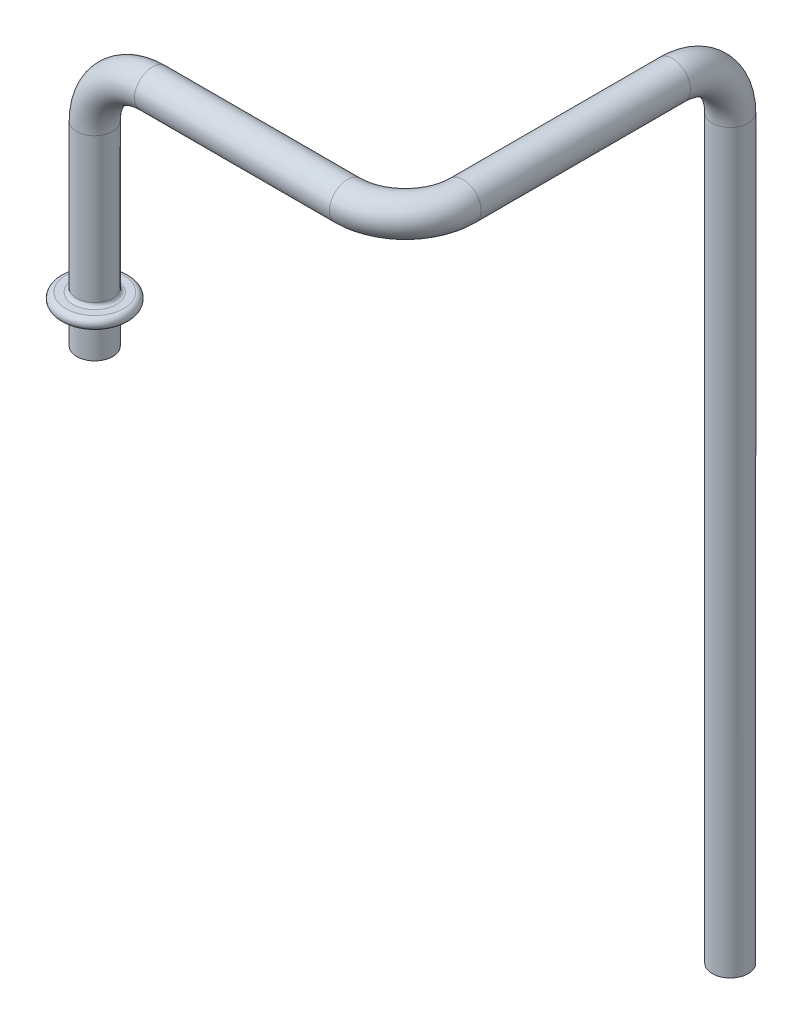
ISO-10303-21;
HEADER;
FILE_DESCRIPTION(('STEP AP214'),'2;1');
FILE_NAME('part.step','',(''),(''),'','','');
FILE_SCHEMA(('AUTOMOTIVE_DESIGN { 1 0 10303 214 1 1 1 1 }'));
ENDSEC;
DATA;
#1=APPLICATION_CONTEXT('core data for automotive mechanical design processes');
#2=APPLICATION_PROTOCOL_DEFINITION('international standard','automotive_design',2000,#1);
#3=PRODUCT_CONTEXT('',#1,'mechanical');
#4=PRODUCT('Part','Part','',(#3));
#5=PRODUCT_RELATED_PRODUCT_CATEGORY('part','',(#4));
#6=PRODUCT_DEFINITION_FORMATION('','',#4);
#7=PRODUCT_DEFINITION_CONTEXT('part definition',#1,'design');
#8=PRODUCT_DEFINITION('design','',#6,#7);
#9=PRODUCT_DEFINITION_SHAPE('','',#8);
#10=(LENGTH_UNIT() NAMED_UNIT(*) SI_UNIT(.MILLI.,.METRE.));
#11=(NAMED_UNIT(*) PLANE_ANGLE_UNIT() SI_UNIT($,.RADIAN.));
#12=(NAMED_UNIT(*) SI_UNIT($,.STERADIAN.) SOLID_ANGLE_UNIT());
#13=UNCERTAINTY_MEASURE_WITH_UNIT(LENGTH_MEASURE(1.E-05),#10,'distance_accuracy_value','');
#14=(GEOMETRIC_REPRESENTATION_CONTEXT(3) GLOBAL_UNCERTAINTY_ASSIGNED_CONTEXT((#13)) GLOBAL_UNIT_ASSIGNED_CONTEXT((#10,
#11,#12)) REPRESENTATION_CONTEXT('',''));
#15=CARTESIAN_POINT('',(0.,0.,0.));
#16=DIRECTION('',(0.,0.,1.));
#17=DIRECTION('',(1.,0.,0.));
#18=AXIS2_PLACEMENT_3D('',#15,#16,#17);
#19=CARTESIAN_POINT('',(0.,27.,0.));
#20=DIRECTION('',(0.,-1.,0.));
#21=DIRECTION('',(0.,0.,-1.));
#22=AXIS2_PLACEMENT_3D('',#19,#20,#21);
#23=CYLINDRICAL_SURFACE('',#22,2.5);
#24=CARTESIAN_POINT('',(0.,4.5,0.));
#25=DIRECTION('',(0.,1.,0.));
#26=DIRECTION('',(0.,0.,1.));
#27=AXIS2_PLACEMENT_3D('',#24,#25,#26);
#28=CIRCLE('',#27,2.5);
#29=CARTESIAN_POINT('',(0.,4.5,2.5));
#30=VERTEX_POINT('',#29);
#31=EDGE_CURVE('E48',#30,#30,#28,.F.);
#32=ORIENTED_EDGE('',*,*,#31,.T.);
#33=EDGE_LOOP('',(#32));
#34=FACE_BOUND('',#33,.T.);
#35=CARTESIAN_POINT('',(0.,0.,0.));
#36=DIRECTION('',(0.,1.,0.));
#37=DIRECTION('',(0.,0.,1.));
#38=AXIS2_PLACEMENT_3D('',#35,#36,#37);
#39=CIRCLE('',#38,2.5);
#40=CARTESIAN_POINT('',(0.,0.,2.5));
#41=VERTEX_POINT('',#40);
#42=EDGE_CURVE('E80',#41,#41,#39,.T.);
#43=ORIENTED_EDGE('',*,*,#42,.T.);
#44=EDGE_LOOP('',(#43));
#45=FACE_BOUND('',#44,.T.);
#46=ADVANCED_FACE('F34',(#34,#45),#23,.T.);
#47=CARTESIAN_POINT('',(0.,7.,0.));
#48=DIRECTION('',(0.,-1.,0.));
#49=DIRECTION('',(0.,0.,-1.));
#50=AXIS2_PLACEMENT_3D('',#47,#48,#49);
#51=CIRCLE('',#50,2.5);
#52=CARTESIAN_POINT('',(0.,7.,-2.5));
#53=VERTEX_POINT('',#52);
#54=EDGE_CURVE('E10',#53,#53,#51,.F.);
#55=ORIENTED_EDGE('',*,*,#54,.T.);
#56=EDGE_LOOP('',(#55));
#57=FACE_BOUND('',#56,.T.);
#58=CARTESIAN_POINT('',(0.,27.,0.));
#59=DIRECTION('',(0.,1.,0.));
#60=DIRECTION('',(0.,0.,1.));
#61=AXIS2_PLACEMENT_3D('',#58,#59,#60);
#62=CIRCLE('',#61,2.5);
#63=CARTESIAN_POINT('',(-2.5,27.,0.));
#64=VERTEX_POINT('',#63);
#65=EDGE_CURVE('E79',#64,#64,#62,.T.);
#66=ORIENTED_EDGE('',*,*,#65,.F.);
#67=EDGE_LOOP('',(#66));
#68=FACE_BOUND('',#67,.T.);
#69=ADVANCED_FACE('F137',(#57,#68),#23,.T.);
#70=CARTESIAN_POINT('',(43.,27.,-45.));
#71=DIRECTION('',(0.,-1.,0.));
#72=DIRECTION('',(0.,0.,-1.));
#73=AXIS2_PLACEMENT_3D('',#70,#71,#72);
#74=CYLINDRICAL_SURFACE('',#73,2.5);
#75=CARTESIAN_POINT('',(43.,27.,-45.));
#76=DIRECTION('',(0.,-1.,0.));
#77=DIRECTION('',(1.,0.,0.));
#78=AXIS2_PLACEMENT_3D('',#75,#76,#77);
#79=CIRCLE('',#78,2.5);
#80=CARTESIAN_POINT('',(43.,27.,-47.5));
#81=VERTEX_POINT('',#80);
#82=EDGE_CURVE('E61',#81,#81,#79,.T.);
#83=ORIENTED_EDGE('',*,*,#82,.T.);
#84=EDGE_LOOP('',(#83));
#85=FACE_BOUND('',#84,.T.);
#86=CARTESIAN_POINT('',(43.,-75.,-45.));
#87=DIRECTION('',(0.,-1.,0.));
#88=DIRECTION('',(1.,0.,0.));
#89=AXIS2_PLACEMENT_3D('',#86,#87,#88);
#90=CIRCLE('',#89,2.5);
#91=CARTESIAN_POINT('',(45.5,-75.,-45.));
#92=VERTEX_POINT('',#91);
#93=EDGE_CURVE('E58',#92,#92,#90,.T.);
#94=ORIENTED_EDGE('',*,*,#93,.F.);
#95=EDGE_LOOP('',(#94));
#96=FACE_BOUND('',#95,.T.);
#97=ADVANCED_FACE('F143',(#85,#96),#74,.T.);
#98=CARTESIAN_POINT('',(43.,27.,-37.));
#99=DIRECTION('',(-1.,0.,0.));
#100=DIRECTION('',(0.,0.,1.));
#101=AXIS2_PLACEMENT_3D('',#98,#99,#100);
#102=TOROIDAL_SURFACE('',#101,8.,2.5);
#103=CARTESIAN_POINT('',(43.,35.,-37.));
#104=DIRECTION('',(0.,0.,-1.));
#105=DIRECTION('',(1.,0.,0.));
#106=AXIS2_PLACEMENT_3D('',#103,#104,#105);
#107=CIRCLE('',#106,2.5);
#108=CARTESIAN_POINT('',(43.,37.5,-37.));
#109=VERTEX_POINT('',#108);
#110=EDGE_CURVE('E65',#109,#109,#107,.T.);
#111=CARTESIAN_POINT('',(43.,27.,-37.));
#112=DIRECTION('',(-1.,0.,0.));
#113=DIRECTION('',(0.,0.,1.));
#114=AXIS2_PLACEMENT_3D('',#111,#112,#113);
#115=CIRCLE('',#114,10.5);
#116=EDGE_CURVE('',#109,#81,#115,.T.);
#117=ORIENTED_EDGE('',*,*,#110,.T.);
#118=ORIENTED_EDGE('',*,*,#82,.F.);
#119=ORIENTED_EDGE('',*,*,#116,.T.);
#120=ORIENTED_EDGE('',*,*,#116,.F.);
#121=EDGE_LOOP('',(#117,#119,#118,#120));
#122=FACE_BOUND('',#121,.T.);
#123=ADVANCED_FACE('F165',(#122),#102,.T.);
#124=CARTESIAN_POINT('',(43.,35.,-8.));
#125=DIRECTION('',(0.,0.,-1.));
#126=DIRECTION('',(-1.,0.,0.));
#127=AXIS2_PLACEMENT_3D('',#124,#125,#126);
#128=CYLINDRICAL_SURFACE('',#127,2.5);
#129=CARTESIAN_POINT('',(43.,35.,-8.));
#130=DIRECTION('',(0.,0.,-1.));
#131=DIRECTION('',(1.,0.,0.));
#132=AXIS2_PLACEMENT_3D('',#129,#130,#131);
#133=CIRCLE('',#132,2.5);
#134=CARTESIAN_POINT('',(45.5,35.,-8.));
#135=VERTEX_POINT('',#134);
#136=EDGE_CURVE('E68',#135,#135,#133,.T.);
#137=ORIENTED_EDGE('',*,*,#136,.T.);
#138=EDGE_LOOP('',(#137));
#139=FACE_BOUND('',#138,.T.);
#140=ORIENTED_EDGE('',*,*,#110,.F.);
#141=EDGE_LOOP('',(#140));
#142=FACE_BOUND('',#141,.T.);
#143=ADVANCED_FACE('F161',(#139,#142),#128,.T.);
#144=CARTESIAN_POINT('',(35.,35.,-8.));
#145=DIRECTION('',(0.,1.,0.));
#146=DIRECTION('',(0.,0.,1.));
#147=AXIS2_PLACEMENT_3D('',#144,#145,#146);
#148=TOROIDAL_SURFACE('',#147,8.,2.5);
#149=CARTESIAN_POINT('',(35.,35.,0.));
#150=DIRECTION('',(1.,0.,0.));
#151=DIRECTION('',(0.,0.,1.));
#152=AXIS2_PLACEMENT_3D('',#149,#150,#151);
#153=CIRCLE('',#152,2.5);
#154=CARTESIAN_POINT('',(35.,35.,2.5));
#155=VERTEX_POINT('',#154);
#156=EDGE_CURVE('E72',#155,#155,#153,.T.);
#157=CARTESIAN_POINT('',(35.,35.,-8.));
#158=DIRECTION('',(0.,1.,0.));
#159=DIRECTION('',(0.,0.,1.));
#160=AXIS2_PLACEMENT_3D('',#157,#158,#159);
#161=CIRCLE('',#160,10.5);
#162=EDGE_CURVE('',#155,#135,#161,.T.);
#163=ORIENTED_EDGE('',*,*,#156,.T.);
#164=ORIENTED_EDGE('',*,*,#136,.F.);
#165=ORIENTED_EDGE('',*,*,#162,.T.);
#166=ORIENTED_EDGE('',*,*,#162,.F.);
#167=EDGE_LOOP('',(#163,#165,#164,#166));
#168=FACE_BOUND('',#167,.T.);
#169=ADVANCED_FACE('F157',(#168),#148,.T.);
#170=CARTESIAN_POINT('',(8.,35.,0.));
#171=DIRECTION('',(1.,0.,0.));
#172=DIRECTION('',(0.,0.,-1.));
#173=AXIS2_PLACEMENT_3D('',#170,#171,#172);
#174=CYLINDRICAL_SURFACE('',#173,2.5);
#175=CARTESIAN_POINT('',(8.,35.,0.));
#176=DIRECTION('',(1.,0.,0.));
#177=DIRECTION('',(0.,0.,1.));
#178=AXIS2_PLACEMENT_3D('',#175,#176,#177);
#179=CIRCLE('',#178,2.5);
#180=CARTESIAN_POINT('',(8.,37.5,0.));
#181=VERTEX_POINT('',#180);
#182=EDGE_CURVE('E76',#181,#181,#179,.T.);
#183=ORIENTED_EDGE('',*,*,#182,.T.);
#184=EDGE_LOOP('',(#183));
#185=FACE_BOUND('',#184,.T.);
#186=ORIENTED_EDGE('',*,*,#156,.F.);
#187=EDGE_LOOP('',(#186));
#188=FACE_BOUND('',#187,.T.);
#189=ADVANCED_FACE('F153',(#185,#188),#174,.T.);
#190=CARTESIAN_POINT('',(8.,27.,0.));
#191=DIRECTION('',(0.,0.,-1.));
#192=DIRECTION('',(-1.,0.,0.));
#193=AXIS2_PLACEMENT_3D('',#190,#191,#192);
#194=TOROIDAL_SURFACE('',#193,8.,2.5);
#195=CARTESIAN_POINT('',(8.,27.,0.));
#196=DIRECTION('',(0.,0.,-1.));
#197=DIRECTION('',(-1.,0.,0.));
#198=AXIS2_PLACEMENT_3D('',#195,#196,#197);
#199=CIRCLE('',#198,10.5);
#200=EDGE_CURVE('',#64,#181,#199,.T.);
#201=ORIENTED_EDGE('',*,*,#65,.T.);
#202=ORIENTED_EDGE('',*,*,#182,.F.);
#203=ORIENTED_EDGE('',*,*,#200,.T.);
#204=ORIENTED_EDGE('',*,*,#200,.F.);
#205=EDGE_LOOP('',(#201,#203,#202,#204));
#206=FACE_BOUND('',#205,.T.);
#207=ADVANCED_FACE('F149',(#206),#194,.T.);
#208=CARTESIAN_POINT('',(43.,-75.,-45.));
#209=DIRECTION('',(0.,-1.,0.));
#210=DIRECTION('',(1.,0.,0.));
#211=AXIS2_PLACEMENT_3D('',#208,#209,#210);
#212=PLANE('',#211);
#213=CARTESIAN_POINT('',(43.,-75.,-45.));
#214=DIRECTION('',(0.,-1.,0.));
#215=DIRECTION('',(0.,0.,-1.));
#216=AXIS2_PLACEMENT_3D('',#213,#214,#215);
#217=CIRCLE('',#216,2.);
#218=CARTESIAN_POINT('',(43.,-75.,-47.));
#219=VERTEX_POINT('',#218);
#220=EDGE_CURVE('E84',#219,#219,#217,.T.);
#221=ORIENTED_EDGE('',*,*,#220,.F.);
#222=EDGE_LOOP('',(#221));
#223=FACE_BOUND('',#222,.T.);
#224=ORIENTED_EDGE('',*,*,#93,.T.);
#225=EDGE_LOOP('',(#224));
#226=FACE_BOUND('',#225,.T.);
#227=ADVANCED_FACE('F152',(#223,#226),#212,.T.);
#228=CARTESIAN_POINT('',(0.,0.,0.));
#229=DIRECTION('',(0.,1.,0.));
#230=DIRECTION('',(0.,0.,1.));
#231=AXIS2_PLACEMENT_3D('',#228,#229,#230);
#232=PLANE('',#231);
#233=CARTESIAN_POINT('',(0.,0.,0.));
#234=DIRECTION('',(0.,1.,0.));
#235=DIRECTION('',(0.,0.,1.));
#236=AXIS2_PLACEMENT_3D('',#233,#234,#235);
#237=CIRCLE('',#236,2.);
#238=CARTESIAN_POINT('',(0.,0.,2.));
#239=VERTEX_POINT('',#238);
#240=EDGE_CURVE('E87',#239,#239,#237,.T.);
#241=ORIENTED_EDGE('',*,*,#240,.T.);
#242=EDGE_LOOP('',(#241));
#243=FACE_BOUND('',#242,.T.);
#244=ORIENTED_EDGE('',*,*,#42,.F.);
#245=EDGE_LOOP('',(#244));
#246=FACE_BOUND('',#245,.T.);
#247=ADVANCED_FACE('F147',(#243,#246),#232,.F.);
#248=CARTESIAN_POINT('',(43.,27.,-45.));
#249=DIRECTION('',(0.,-1.,0.));
#250=DIRECTION('',(0.,0.,-1.));
#251=AXIS2_PLACEMENT_3D('',#248,#249,#250);
#252=CYLINDRICAL_SURFACE('',#251,2.);
#253=CARTESIAN_POINT('',(43.,27.,-45.));
#254=DIRECTION('',(0.,-1.,0.));
#255=DIRECTION('',(0.,0.,-1.));
#256=AXIS2_PLACEMENT_3D('',#253,#254,#255);
#257=CIRCLE('',#256,2.);
#258=CARTESIAN_POINT('',(43.,27.,-47.));
#259=VERTEX_POINT('',#258);
#260=EDGE_CURVE('E94',#259,#259,#257,.T.);
#261=ORIENTED_EDGE('',*,*,#260,.F.);
#262=EDGE_LOOP('',(#261));
#263=FACE_BOUND('',#262,.T.);
#264=ORIENTED_EDGE('',*,*,#220,.T.);
#265=EDGE_LOOP('',(#264));
#266=FACE_BOUND('',#265,.T.);
#267=ADVANCED_FACE('F183',(#263,#266),#252,.F.);
#268=CARTESIAN_POINT('',(43.,27.,-37.));
#269=DIRECTION('',(-1.,0.,0.));
#270=DIRECTION('',(0.,0.,1.));
#271=AXIS2_PLACEMENT_3D('',#268,#269,#270);
#272=TOROIDAL_SURFACE('',#271,8.,2.);
#273=CARTESIAN_POINT('',(43.,35.,-37.));
#274=DIRECTION('',(0.,0.,1.));
#275=DIRECTION('',(0.,-1.,0.));
#276=AXIS2_PLACEMENT_3D('',#273,#274,#275);
#277=CIRCLE('',#276,2.);
#278=CARTESIAN_POINT('',(43.,37.,-37.));
#279=VERTEX_POINT('',#278);
#280=EDGE_CURVE('E108',#279,#279,#277,.F.);
#281=CARTESIAN_POINT('',(43.,27.,-37.));
#282=DIRECTION('',(-1.,0.,0.));
#283=DIRECTION('',(0.,0.,1.));
#284=AXIS2_PLACEMENT_3D('',#281,#282,#283);
#285=CIRCLE('',#284,10.);
#286=EDGE_CURVE('',#279,#259,#285,.T.);
#287=ORIENTED_EDGE('',*,*,#280,.F.);
#288=ORIENTED_EDGE('',*,*,#260,.T.);
#289=ORIENTED_EDGE('',*,*,#286,.T.);
#290=ORIENTED_EDGE('',*,*,#286,.F.);
#291=EDGE_LOOP('',(#287,#289,#288,#290));
#292=FACE_BOUND('',#291,.T.);
#293=ADVANCED_FACE('F206',(#292),#272,.F.);
#294=CARTESIAN_POINT('',(43.,35.,-8.));
#295=DIRECTION('',(0.,0.,-1.));
#296=DIRECTION('',(-1.,0.,0.));
#297=AXIS2_PLACEMENT_3D('',#294,#295,#296);
#298=CYLINDRICAL_SURFACE('',#297,2.);
#299=CARTESIAN_POINT('',(43.,35.,-8.));
#300=DIRECTION('',(0.,0.,-1.));
#301=DIRECTION('',(-1.,0.,0.));
#302=AXIS2_PLACEMENT_3D('',#299,#300,#301);
#303=CIRCLE('',#302,2.);
#304=CARTESIAN_POINT('',(45.,35.,-8.));
#305=VERTEX_POINT('',#304);
#306=EDGE_CURVE('E104',#305,#305,#303,.T.);
#307=ORIENTED_EDGE('',*,*,#306,.F.);
#308=EDGE_LOOP('',(#307));
#309=FACE_BOUND('',#308,.T.);
#310=ORIENTED_EDGE('',*,*,#280,.T.);
#311=EDGE_LOOP('',(#310));
#312=FACE_BOUND('',#311,.T.);
#313=ADVANCED_FACE('F202',(#309,#312),#298,.F.);
#314=CARTESIAN_POINT('',(35.,35.,-8.));
#315=DIRECTION('',(0.,1.,0.));
#316=DIRECTION('',(0.,0.,1.));
#317=AXIS2_PLACEMENT_3D('',#314,#315,#316);
#318=TOROIDAL_SURFACE('',#317,8.,2.);
#319=CARTESIAN_POINT('',(35.,35.,0.));
#320=DIRECTION('',(-1.,0.,0.));
#321=DIRECTION('',(0.,0.,1.));
#322=AXIS2_PLACEMENT_3D('',#319,#320,#321);
#323=CIRCLE('',#322,2.);
#324=CARTESIAN_POINT('',(35.,35.,2.));
#325=VERTEX_POINT('',#324);
#326=EDGE_CURVE('E100',#325,#325,#323,.F.);
#327=CARTESIAN_POINT('',(35.,35.,-8.));
#328=DIRECTION('',(0.,1.,0.));
#329=DIRECTION('',(0.,0.,1.));
#330=AXIS2_PLACEMENT_3D('',#327,#328,#329);
#331=CIRCLE('',#330,10.);
#332=EDGE_CURVE('',#325,#305,#331,.T.);
#333=ORIENTED_EDGE('',*,*,#326,.F.);
#334=ORIENTED_EDGE('',*,*,#306,.T.);
#335=ORIENTED_EDGE('',*,*,#332,.T.);
#336=ORIENTED_EDGE('',*,*,#332,.F.);
#337=EDGE_LOOP('',(#333,#335,#334,#336));
#338=FACE_BOUND('',#337,.T.);
#339=ADVANCED_FACE('F198',(#338),#318,.F.);
#340=CARTESIAN_POINT('',(8.,35.,0.));
#341=DIRECTION('',(1.,0.,0.));
#342=DIRECTION('',(0.,0.,-1.));
#343=AXIS2_PLACEMENT_3D('',#340,#341,#342);
#344=CYLINDRICAL_SURFACE('',#343,2.);
#345=CARTESIAN_POINT('',(8.,35.,0.));
#346=DIRECTION('',(1.,0.,0.));
#347=DIRECTION('',(0.,0.,-1.));
#348=AXIS2_PLACEMENT_3D('',#345,#346,#347);
#349=CIRCLE('',#348,2.);
#350=CARTESIAN_POINT('',(8.,37.,0.));
#351=VERTEX_POINT('',#350);
#352=EDGE_CURVE('E97',#351,#351,#349,.T.);
#353=ORIENTED_EDGE('',*,*,#352,.F.);
#354=EDGE_LOOP('',(#353));
#355=FACE_BOUND('',#354,.T.);
#356=ORIENTED_EDGE('',*,*,#326,.T.);
#357=EDGE_LOOP('',(#356));
#358=FACE_BOUND('',#357,.T.);
#359=ADVANCED_FACE('F194',(#355,#358),#344,.F.);
#360=CARTESIAN_POINT('',(8.,27.,0.));
#361=DIRECTION('',(0.,0.,-1.));
#362=DIRECTION('',(-1.,0.,0.));
#363=AXIS2_PLACEMENT_3D('',#360,#361,#362);
#364=TOROIDAL_SURFACE('',#363,8.,2.);
#365=CARTESIAN_POINT('',(0.,27.,0.));
#366=DIRECTION('',(0.,-1.,0.));
#367=DIRECTION('',(0.,0.,-1.));
#368=AXIS2_PLACEMENT_3D('',#365,#366,#367);
#369=CIRCLE('',#368,2.);
#370=CARTESIAN_POINT('',(-2.,27.,0.));
#371=VERTEX_POINT('',#370);
#372=EDGE_CURVE('E90',#371,#371,#369,.F.);
#373=CARTESIAN_POINT('',(8.,27.,0.));
#374=DIRECTION('',(0.,0.,-1.));
#375=DIRECTION('',(-1.,0.,0.));
#376=AXIS2_PLACEMENT_3D('',#373,#374,#375);
#377=CIRCLE('',#376,10.);
#378=EDGE_CURVE('',#371,#351,#377,.T.);
#379=ORIENTED_EDGE('',*,*,#372,.F.);
#380=ORIENTED_EDGE('',*,*,#352,.T.);
#381=ORIENTED_EDGE('',*,*,#378,.T.);
#382=ORIENTED_EDGE('',*,*,#378,.F.);
#383=EDGE_LOOP('',(#379,#381,#380,#382));
#384=FACE_BOUND('',#383,.T.);
#385=ADVANCED_FACE('F190',(#384),#364,.F.);
#386=CARTESIAN_POINT('',(0.,27.,0.));
#387=DIRECTION('',(0.,-1.,0.));
#388=DIRECTION('',(0.,0.,-1.));
#389=AXIS2_PLACEMENT_3D('',#386,#387,#388);
#390=CYLINDRICAL_SURFACE('',#389,2.);
#391=ORIENTED_EDGE('',*,*,#372,.T.);
#392=EDGE_LOOP('',(#391));
#393=FACE_BOUND('',#392,.T.);
#394=ORIENTED_EDGE('',*,*,#240,.F.);
#395=EDGE_LOOP('',(#394));
#396=FACE_BOUND('',#395,.T.);
#397=ADVANCED_FACE('F187',(#393,#396),#390,.F.);
#398=CARTESIAN_POINT('',(0.,5.,2.5));
#399=DIRECTION('',(0.,1.,0.));
#400=DIRECTION('',(0.,0.,1.));
#401=AXIS2_PLACEMENT_3D('',#398,#399,#400);
#402=PLANE('',#401);
#403=CARTESIAN_POINT('',(0.,5.,0.));
#404=DIRECTION('',(0.,1.,0.));
#405=DIRECTION('',(0.,0.,1.));
#406=AXIS2_PLACEMENT_3D('',#403,#404,#405);
#407=CIRCLE('',#406,3.);
#408=CARTESIAN_POINT('',(0.,5.,3.));
#409=VERTEX_POINT('',#408);
#410=EDGE_CURVE('E53',#409,#409,#407,.T.);
#411=ORIENTED_EDGE('',*,*,#410,.T.);
#412=EDGE_LOOP('',(#411));
#413=FACE_BOUND('',#412,.T.);
#414=CARTESIAN_POINT('',(0.,5.,0.));
#415=DIRECTION('',(0.,-1.,0.));
#416=DIRECTION('',(0.,0.,-1.));
#417=AXIS2_PLACEMENT_3D('',#414,#415,#416);
#418=CIRCLE('',#417,4.);
#419=CARTESIAN_POINT('',(0.,5.,-4.));
#420=VERTEX_POINT('',#419);
#421=EDGE_CURVE('E91',#420,#420,#418,.T.);
#422=ORIENTED_EDGE('',*,*,#421,.T.);
#423=EDGE_LOOP('',(#422));
#424=FACE_BOUND('',#423,.T.);
#425=ADVANCED_FACE('F133',(#413,#424),#402,.F.);
#426=CARTESIAN_POINT('',(0.,5.75,0.));
#427=DIRECTION('',(0.,-1.,0.));
#428=DIRECTION('',(0.,0.,-1.));
#429=AXIS2_PLACEMENT_3D('',#426,#427,#428);
#430=TOROIDAL_SURFACE('',#429,4.,0.749999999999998);
#431=ORIENTED_EDGE('',*,*,#421,.F.);
#432=EDGE_LOOP('',(#431));
#433=FACE_BOUND('',#432,.T.);
#434=CARTESIAN_POINT('',(0.,6.5,0.));
#435=DIRECTION('',(0.,-1.,0.));
#436=DIRECTION('',(0.,0.,-1.));
#437=AXIS2_PLACEMENT_3D('',#434,#435,#436);
#438=CIRCLE('',#437,4.);
#439=CARTESIAN_POINT('',(0.,6.5,-4.));
#440=VERTEX_POINT('',#439);
#441=EDGE_CURVE('E117',#440,#440,#438,.T.);
#442=ORIENTED_EDGE('',*,*,#441,.T.);
#443=EDGE_LOOP('',(#442));
#444=FACE_BOUND('',#443,.T.);
#445=ADVANCED_FACE('F122',(#433,#444),#430,.T.);
#446=CARTESIAN_POINT('',(0.,6.5,4.));
#447=DIRECTION('',(0.,-1.,0.));
#448=DIRECTION('',(0.,0.,-1.));
#449=AXIS2_PLACEMENT_3D('',#446,#447,#448);
#450=PLANE('',#449);
#451=CARTESIAN_POINT('',(0.,6.5,0.));
#452=DIRECTION('',(0.,-1.,0.));
#453=DIRECTION('',(0.,0.,-1.));
#454=AXIS2_PLACEMENT_3D('',#451,#452,#453);
#455=CIRCLE('',#454,3.);
#456=CARTESIAN_POINT('',(0.,6.5,-3.));
#457=VERTEX_POINT('',#456);
#458=EDGE_CURVE('E42',#457,#457,#455,.T.);
#459=ORIENTED_EDGE('',*,*,#458,.T.);
#460=EDGE_LOOP('',(#459));
#461=FACE_BOUND('',#460,.T.);
#462=ORIENTED_EDGE('',*,*,#441,.F.);
#463=EDGE_LOOP('',(#462));
#464=FACE_BOUND('',#463,.T.);
#465=ADVANCED_FACE('F124',(#461,#464),#450,.F.);
#466=CARTESIAN_POINT('',(0.,4.5,0.));
#467=DIRECTION('',(0.,1.,0.));
#468=DIRECTION('',(0.,0.,1.));
#469=AXIS2_PLACEMENT_3D('',#466,#467,#468);
#470=TOROIDAL_SURFACE('',#469,3.,0.5);
#471=ORIENTED_EDGE('',*,*,#31,.F.);
#472=EDGE_LOOP('',(#471));
#473=FACE_BOUND('',#472,.T.);
#474=ORIENTED_EDGE('',*,*,#410,.F.);
#475=EDGE_LOOP('',(#474));
#476=FACE_BOUND('',#475,.T.);
#477=ADVANCED_FACE('F126',(#473,#476),#470,.F.);
#478=CARTESIAN_POINT('',(0.,7.,0.));
#479=DIRECTION('',(0.,-1.,0.));
#480=DIRECTION('',(0.,0.,-1.));
#481=AXIS2_PLACEMENT_3D('',#478,#479,#480);
#482=TOROIDAL_SURFACE('',#481,3.,0.5);
#483=ORIENTED_EDGE('',*,*,#54,.F.);
#484=EDGE_LOOP('',(#483));
#485=FACE_BOUND('',#484,.T.);
#486=ORIENTED_EDGE('',*,*,#458,.F.);
#487=EDGE_LOOP('',(#486));
#488=FACE_BOUND('',#487,.T.);
#489=ADVANCED_FACE('F36',(#485,#488),#482,.F.);
#490=CLOSED_SHELL('',(#46,#69,#97,#123,#143,#169,#189,#207,#227,#247,#267,#293,#313,#339,#359,
#385,#397,#425,#445,#465,#477,#489));
#491=MANIFOLD_SOLID_BREP('B2',#490);
#492=ADVANCED_BREP_SHAPE_REPRESENTATION('',(#18,#491),#14);
#493=SHAPE_DEFINITION_REPRESENTATION(#9,#492);
ENDSEC;
END-ISO-10303-21;
